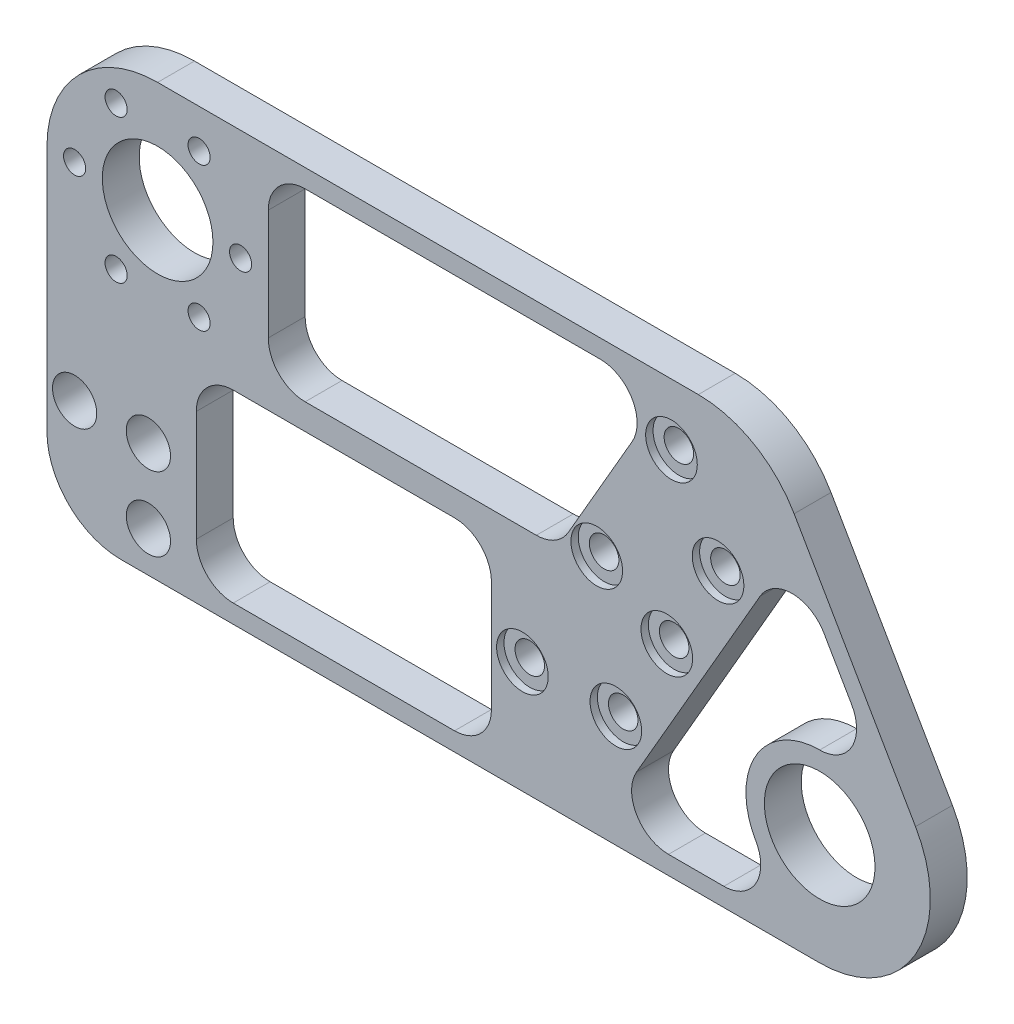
from build123d import *

# Parameters (mm, degrees)
ESQUISSE1_R             = 15
ESQUISSE1_R_2           = 3
ESQUISSE1_R_3           = 6
ESQUISSE1_R_4           = 4
BOSS_EXTRU_1_DEPTH      = 10
ESQUISSE2_R             = 7
ENL_V_MAT_EXTRU_1_DEPTH = 2


with BuildPart() as part:
    # Esquisse1 → Boss.-Extru.1 (new body)
    with BuildSketch(Plane.XY):
        with BuildLine():
            Line((20, 0), (209.5, 0))
            ThreePointArc((209.5, 0), (235.480762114, 15), (235.480762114, 45))
            Line((235.480762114, 45), (202.57179677, 102))
            ThreePointArc((202.57179677, 102), (191.591034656, 112.980762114), (176.591034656, 117))
            Line((176.591034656, 117), (30, 117))
            ThreePointArc((30, 117), (8.786796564, 108.213203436), (0, 87))
            Line((0, 87), (0, 20))
            ThreePointArc((0, 20), (5.857864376, 5.857864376), (20, 0))
        make_face()
        with Locations((30, 87)):
            Circle(ESQUISSE1_R, mode=Mode.SUBTRACT)
        with Locations((7.5, 87)):
            Circle(ESQUISSE1_R_2, mode=Mode.SUBTRACT)
        with Locations((18.75, 67.514428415)):
            Circle(ESQUISSE1_R_2, mode=Mode.SUBTRACT)
        with Locations((41.25, 67.514428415)):
            Circle(ESQUISSE1_R_2, mode=Mode.SUBTRACT)
        with Locations((52.5, 87)):
            Circle(ESQUISSE1_R_2, mode=Mode.SUBTRACT)
        with Locations((41.25, 106.485571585)):
            Circle(ESQUISSE1_R_2, mode=Mode.SUBTRACT)
        with Locations((18.75, 106.485571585)):
            Circle(ESQUISSE1_R_2, mode=Mode.SUBTRACT)
        with Locations((7.5, 31)):
            Circle(ESQUISSE1_R_3, mode=Mode.SUBTRACT)
        with Locations((27.5, 31)):
            Circle(ESQUISSE1_R_3, mode=Mode.SUBTRACT)
        with Locations((27.5, 11)):
            Circle(ESQUISSE1_R_3, mode=Mode.SUBTRACT)
        with Locations((209.5, 30)):
            Circle(ESQUISSE1_R, mode=Mode.SUBTRACT)
        with Locations((181.946056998, 78.275170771)):
            Circle(ESQUISSE1_R_4, mode=Mode.SUBTRACT)
        with Locations((168.0495925, 54.205788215)):
            Circle(ESQUISSE1_R_4, mode=Mode.SUBTRACT)
        with Locations((154.23233851, 30.273602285)):
            Circle(ESQUISSE1_R_4, mode=Mode.SUBTRACT)
        with Locations((128.901326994, 30.399003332)):
            Circle(ESQUISSE1_R_4, mode=Mode.SUBTRACT)
        with Locations((149.051489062, 65.300107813)):
            Circle(ESQUISSE1_R_4, mode=Mode.SUBTRACT)
        with Locations((169.317166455, 100.401290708)):
            Circle(ESQUISSE1_R_4, mode=Mode.SUBTRACT)
        with BuildLine():
            Line((60, 102), (60, 72))
            ThreePointArc((60, 72), (62.928932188, 64.928932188), (70, 62))
            Line((70, 62), (132.679491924, 62))
            ThreePointArc((132.679491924, 62), (137.679491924, 63.339745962), (141.339745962, 67))
            Line((141.339745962, 67), (158.660254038, 97))
            ThreePointArc((158.660254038, 97), (158.660254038, 107), (150, 112))
            Line((150, 112), (70, 112))
            ThreePointArc((70, 112), (62.928932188, 109.071067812), (60, 102))
        make_face(mode=Mode.SUBTRACT)
        with BuildLine():
            Line((183.519237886, 5), (168.508130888, 5))
            ThreePointArc((168.508130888, 5), (159.84787685, 10), (159.84787685, 20))
            Line((159.84787685, 20), (193.334192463, 78))
            ThreePointArc((193.334192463, 78), (201.994446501, 83), (210.654700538, 78))
            Line((210.654700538, 78), (218.160254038, 65))
            ThreePointArc((218.160254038, 65), (218.160254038, 55), (209.5, 50))
            ThreePointArc((209.5, 50), (192.179491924, 40), (192.179491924, 20))
            ThreePointArc((192.179491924, 20), (192.179491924, 10), (183.519237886, 5))
        make_face(mode=Mode.SUBTRACT)
        with BuildLine():
            Line((50.5, 55), (110.5, 55))
            ThreePointArc((110.5, 55), (117.571067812, 52.071067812), (120.5, 45))
            Line((120.5, 45), (120.5, 15))
            ThreePointArc((120.5, 15), (117.571067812, 7.928932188), (110.5, 5))
            Line((110.5, 5), (50.5, 5))
            ThreePointArc((50.5, 5), (43.428932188, 7.928932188), (40.5, 15))
            Line((40.5, 15), (40.5, 45))
            ThreePointArc((40.5, 45), (43.428932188, 52.071067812), (50.5, 55))
        make_face(mode=Mode.SUBTRACT)
    extrude(amount=BOSS_EXTRU_1_DEPTH)

    # Esquisse2 → Enl_v. mat.-Extru.1 (cut)
    with BuildSketch(Plane.XY.offset(10)):
        with Locations((149.051489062, 65.300107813)):
            Circle(ESQUISSE2_R)
        with Locations((169.317166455, 100.401290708)):
            Circle(ESQUISSE2_R)
        with Locations((181.946056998, 78.275170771)):
            Circle(ESQUISSE2_R)
        with Locations((168.0495925, 54.205788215)):
            Circle(ESQUISSE2_R)
        with Locations((154.23233851, 30.273602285)):
            Circle(ESQUISSE2_R)
        with Locations((128.901326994, 30.399003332)):
            Circle(ESQUISSE2_R)
    extrude(amount=-ENL_V_MAT_EXTRU_1_DEPTH, mode=Mode.SUBTRACT)


solid = part.part
